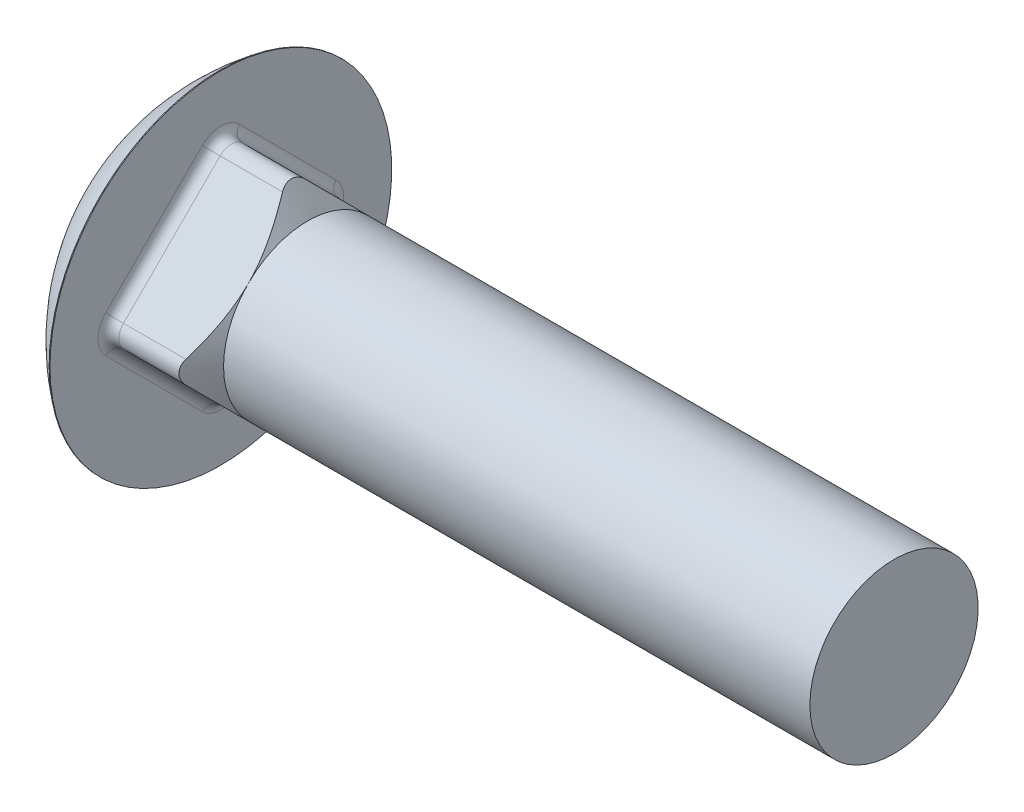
ISO-10303-21;
HEADER;
FILE_DESCRIPTION(('STEP AP214'),'2;1');
FILE_NAME('part.step','',(''),(''),'','','');
FILE_SCHEMA(('AUTOMOTIVE_DESIGN { 1 0 10303 214 1 1 1 1 }'));
ENDSEC;
DATA;
#1=APPLICATION_CONTEXT('core data for automotive mechanical design processes');
#2=APPLICATION_PROTOCOL_DEFINITION('international standard','automotive_design',2000,#1);
#3=PRODUCT_CONTEXT('',#1,'mechanical');
#4=PRODUCT('Part','Part','',(#3));
#5=PRODUCT_RELATED_PRODUCT_CATEGORY('part','',(#4));
#6=PRODUCT_DEFINITION_FORMATION('','',#4);
#7=PRODUCT_DEFINITION_CONTEXT('part definition',#1,'design');
#8=PRODUCT_DEFINITION('design','',#6,#7);
#9=PRODUCT_DEFINITION_SHAPE('','',#8);
#10=(LENGTH_UNIT() NAMED_UNIT(*) SI_UNIT(.MILLI.,.METRE.));
#11=(NAMED_UNIT(*) PLANE_ANGLE_UNIT() SI_UNIT($,.RADIAN.));
#12=(NAMED_UNIT(*) SI_UNIT($,.STERADIAN.) SOLID_ANGLE_UNIT());
#13=UNCERTAINTY_MEASURE_WITH_UNIT(LENGTH_MEASURE(1.E-05),#10,'distance_accuracy_value','');
#14=(GEOMETRIC_REPRESENTATION_CONTEXT(3) GLOBAL_UNCERTAINTY_ASSIGNED_CONTEXT((#13)) GLOBAL_UNIT_ASSIGNED_CONTEXT((#10,
#11,#12)) REPRESENTATION_CONTEXT('',''));
#15=CARTESIAN_POINT('',(0.,0.,0.));
#16=DIRECTION('',(0.,0.,1.));
#17=DIRECTION('',(1.,0.,0.));
#18=AXIS2_PLACEMENT_3D('',#15,#16,#17);
#19=CARTESIAN_POINT('',(26.2128,1.68828815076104,16.2722240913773));
#20=DIRECTION('',(0.,-0.707106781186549,-0.707106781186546));
#21=DIRECTION('',(0.,0.707106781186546,-0.707106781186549));
#22=AXIS2_PLACEMENT_3D('',#19,#20,#21);
#23=PLANE('',#22);
#24=CARTESIAN_POINT('',(24.0998422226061,16.2724240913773,1.68808815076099));
#25=CARTESIAN_POINT('',(24.1796497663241,16.1173593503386,1.84315289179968));
#26=CARTESIAN_POINT('',(24.2581086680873,15.9619481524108,1.99856408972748));
#27=CARTESIAN_POINT('',(24.4120519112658,15.6503819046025,2.31013033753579));
#28=CARTESIAN_POINT('',(24.4875360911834,15.4942268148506,2.46628542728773));
#29=CARTESIAN_POINT('',(24.7091843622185,15.024411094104,2.9361011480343));
#30=CARTESIAN_POINT('',(24.8504499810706,14.7095816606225,3.25093058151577));
#31=CARTESIAN_POINT('',(25.1181625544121,14.0744287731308,3.88608346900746));
#32=CARTESIAN_POINT('',(25.2445018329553,13.7540824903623,4.20642975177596));
#33=CARTESIAN_POINT('',(25.4780882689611,13.1099535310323,4.85055871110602));
#34=CARTESIAN_POINT('',(25.5853388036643,12.7861714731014,5.17434076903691));
#35=CARTESIAN_POINT('',(25.7734199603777,12.1487294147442,5.81178282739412));
#36=CARTESIAN_POINT('',(25.8551600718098,11.8352048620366,6.12530738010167));
#37=CARTESIAN_POINT('',(25.995092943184,11.2055045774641,6.75500766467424));
#38=CARTESIAN_POINT('',(26.0532856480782,10.889328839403,7.07118340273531));
#39=CARTESIAN_POINT('',(26.1435202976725,10.2561650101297,7.70434723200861));
#40=CARTESIAN_POINT('',(26.1756494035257,9.93918321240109,8.02132902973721));
#41=CARTESIAN_POINT('',(26.212576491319,9.30442489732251,8.6560873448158));
#42=CARTESIAN_POINT('',(26.2173758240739,8.98664842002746,8.97386382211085));
#43=CARTESIAN_POINT('',(26.2001253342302,8.37636377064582,9.58414847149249));
#44=CARTESIAN_POINT('',(26.1801479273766,8.08382492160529,9.87668732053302));
#45=CARTESIAN_POINT('',(26.1176102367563,7.49996676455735,10.460545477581));
#46=CARTESIAN_POINT('',(26.075049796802,7.20864746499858,10.7518647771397));
#47=CARTESIAN_POINT('',(25.9687884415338,6.62707683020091,11.3334354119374));
#48=CARTESIAN_POINT('',(25.905024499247,6.33683131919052,11.6236809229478));
#49=CARTESIAN_POINT('',(25.7585167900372,5.75877000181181,12.2017422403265));
#50=CARTESIAN_POINT('',(25.6757730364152,5.47095419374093,12.4895580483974));
#51=CARTESIAN_POINT('',(25.4899949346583,4.88652946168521,13.0739827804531));
#52=CARTESIAN_POINT('',(25.3862813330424,4.59002933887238,13.3704829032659));
#53=CARTESIAN_POINT('',(25.1634125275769,3.99992687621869,13.9605853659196));
#54=CARTESIAN_POINT('',(25.0442553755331,3.70632490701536,14.254187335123));
#55=CARTESIAN_POINT('',(24.793661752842,3.12373768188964,14.8367745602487));
#56=CARTESIAN_POINT('',(24.6623049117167,2.83473516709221,15.1257770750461));
#57=CARTESIAN_POINT('',(24.388733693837,2.25945449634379,15.7010577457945));
#58=CARTESIAN_POINT('',(24.2465244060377,1.9731751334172,15.9873371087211));
#59=CARTESIAN_POINT('',(24.0998422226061,1.68808815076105,16.2724240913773));
#60=B_SPLINE_CURVE_WITH_KNOTS('',3,(#24,#25,#26,#27,#28,#29,#30,#31,#32,#33,#34,#35,#36,#37,#38,
#39,#40,#41,#42,#43,#44,#45,#46,#47,#48,#49,#50,#51,#52,#53,#54,#55,#56,#57,#58,#59),
.UNSPECIFIED.,.F.,.F.,(4,2,2,2,2,2,2,2,2,2,2,2,2,2,2,2,2,4),(0.,0.700087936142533,
1.4002138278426,2.80128617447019,4.21191735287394,5.62229870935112,6.9743282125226,
8.32636087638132,9.67385325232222,11.0212790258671,12.2632245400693,13.5051786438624,
14.7508579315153,15.9965363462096,17.2920436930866,18.5877146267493,19.8754544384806,
21.162594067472),.UNSPECIFIED.);
#61=CARTESIAN_POINT('',(24.0999451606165,16.2722240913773,1.68828815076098));
#62=VERTEX_POINT('',#61);
#63=CARTESIAN_POINT('',(26.2128,8.98025612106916,8.98025612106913));
#64=VERTEX_POINT('',#63);
#65=EDGE_CURVE('E58',#62,#64,#60,.T.);
#66=ORIENTED_EDGE('',*,*,#65,.F.);
#67=DIRECTION('',(-1.,0.,0.));
#68=VECTOR('',#67,1.);
#69=CARTESIAN_POINT('',(26.2128,16.2722240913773,1.68828815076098));
#70=LINE('',#69,#68);
#71=CARTESIAN_POINT('',(14.6812,16.2722240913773,1.68828815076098));
#72=VERTEX_POINT('',#71);
#73=EDGE_CURVE('E313',#62,#72,#70,.T.);
#74=ORIENTED_EDGE('',*,*,#73,.T.);
#75=DIRECTION('',(0.,0.707106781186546,-0.707106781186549));
#76=VECTOR('',#75,1.);
#77=CARTESIAN_POINT('',(14.6812,1.68828815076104,16.2722240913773));
#78=LINE('',#77,#76);
#79=CARTESIAN_POINT('',(14.6812,1.68828815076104,16.2722240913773));
#80=VERTEX_POINT('',#79);
#81=EDGE_CURVE('E50',#72,#80,#78,.F.);
#82=ORIENTED_EDGE('',*,*,#81,.T.);
#83=DIRECTION('',(-1.,0.,0.));
#84=VECTOR('',#83,1.);
#85=CARTESIAN_POINT('',(26.2128,1.68828815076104,16.2722240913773));
#86=LINE('',#85,#84);
#87=CARTESIAN_POINT('',(24.0999451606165,1.68828815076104,16.2722240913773));
#88=VERTEX_POINT('',#87);
#89=EDGE_CURVE('E321',#88,#80,#86,.T.);
#90=ORIENTED_EDGE('',*,*,#89,.F.);
#91=EDGE_CURVE('E241',#64,#88,#60,.T.);
#92=ORIENTED_EDGE('',*,*,#91,.F.);
#93=EDGE_LOOP('',(#66,#74,#82,#90,#92));
#94=FACE_BOUND('',#93,.T.);
#95=ADVANCED_FACE('F41',(#94),#23,.F.);
#96=CARTESIAN_POINT('',(26.2128,-16.2722240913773,1.68828815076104));
#97=DIRECTION('',(0.,0.707106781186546,-0.707106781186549));
#98=DIRECTION('',(0.,0.707106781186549,0.707106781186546));
#99=AXIS2_PLACEMENT_3D('',#96,#97,#98);
#100=PLANE('',#99);
#101=CARTESIAN_POINT('',(24.0998422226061,-1.68808815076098,16.2724240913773));
#102=CARTESIAN_POINT('',(24.1796497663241,-1.84315289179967,16.1173593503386));
#103=CARTESIAN_POINT('',(24.2581086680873,-1.99856408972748,15.9619481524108));
#104=CARTESIAN_POINT('',(24.4120519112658,-2.31013033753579,15.6503819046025));
#105=CARTESIAN_POINT('',(24.4875360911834,-2.46628542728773,15.4942268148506));
#106=CARTESIAN_POINT('',(24.7091843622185,-2.93610114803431,15.024411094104));
#107=CARTESIAN_POINT('',(24.8504499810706,-3.25093058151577,14.7095816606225));
#108=CARTESIAN_POINT('',(25.118162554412,-3.88608346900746,14.0744287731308));
#109=CARTESIAN_POINT('',(25.2445018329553,-4.20642975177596,13.7540824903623));
#110=CARTESIAN_POINT('',(25.4780882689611,-4.85055871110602,13.1099535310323));
#111=CARTESIAN_POINT('',(25.5853388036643,-5.17434076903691,12.7861714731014));
#112=CARTESIAN_POINT('',(25.7734199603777,-5.81178282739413,12.1487294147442));
#113=CARTESIAN_POINT('',(25.8551600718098,-6.12530738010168,11.8352048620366));
#114=CARTESIAN_POINT('',(25.995092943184,-6.75500766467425,11.2055045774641));
#115=CARTESIAN_POINT('',(26.0532856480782,-7.07118340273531,10.889328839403));
#116=CARTESIAN_POINT('',(26.1435202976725,-7.70434723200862,10.2561650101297));
#117=CARTESIAN_POINT('',(26.1756494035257,-8.02132902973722,9.93918321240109));
#118=CARTESIAN_POINT('',(26.212576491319,-8.65608734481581,9.3044248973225));
#119=CARTESIAN_POINT('',(26.2173758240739,-8.97386382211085,8.98664842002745));
#120=CARTESIAN_POINT('',(26.2001253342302,-9.5841484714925,8.37636377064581));
#121=CARTESIAN_POINT('',(26.1801479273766,-9.87668732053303,8.08382492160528));
#122=CARTESIAN_POINT('',(26.1176102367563,-10.460545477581,7.49996676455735));
#123=CARTESIAN_POINT('',(26.075049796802,-10.7518647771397,7.20864746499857));
#124=CARTESIAN_POINT('',(25.9687884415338,-11.3334354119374,6.62707683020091));
#125=CARTESIAN_POINT('',(25.905024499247,-11.6236809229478,6.33683131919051));
#126=CARTESIAN_POINT('',(25.7585167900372,-12.2017422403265,5.7587700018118));
#127=CARTESIAN_POINT('',(25.6757730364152,-12.4895580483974,5.47095419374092));
#128=CARTESIAN_POINT('',(25.4899949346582,-13.0739827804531,4.8865294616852));
#129=CARTESIAN_POINT('',(25.3862813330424,-13.3704829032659,4.59002933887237));
#130=CARTESIAN_POINT('',(25.1634125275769,-13.9605853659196,3.99992687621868));
#131=CARTESIAN_POINT('',(25.0442553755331,-14.254187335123,3.70632490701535));
#132=CARTESIAN_POINT('',(24.793661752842,-14.8367745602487,3.12373768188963));
#133=CARTESIAN_POINT('',(24.6623049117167,-15.1257770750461,2.83473516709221));
#134=CARTESIAN_POINT('',(24.388733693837,-15.7010577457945,2.25945449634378));
#135=CARTESIAN_POINT('',(24.2465244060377,-15.9873371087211,1.97317513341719));
#136=CARTESIAN_POINT('',(24.0998422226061,-16.2724240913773,1.68808815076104));
#137=B_SPLINE_CURVE_WITH_KNOTS('',3,(#101,#102,#103,#104,#105,#106,#107,#108,#109,#110,#111,
#112,#113,#114,#115,#116,#117,#118,#119,#120,#121,#122,#123,#124,#125,#126,#127,#128,#129,#130,
#131,#132,#133,#134,#135,#136),.UNSPECIFIED.,.F.,.F.,(4,2,2,2,2,2,2,2,2,2,2,2,2,2,2,2,2,4),(0.,
0.700087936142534,1.4002138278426,2.80128617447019,4.21191735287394,5.62229870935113,
6.97432821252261,8.32636087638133,9.67385325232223,11.0212790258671,12.2632245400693,
13.5051786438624,14.7508579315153,15.9965363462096,17.2920436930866,18.5877146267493,
19.8754544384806,21.162594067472),.UNSPECIFIED.);
#138=CARTESIAN_POINT('',(24.0999451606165,-1.68828815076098,16.2722240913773));
#139=VERTEX_POINT('',#138);
#140=CARTESIAN_POINT('',(26.2128,-8.98025612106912,8.98025612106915));
#141=VERTEX_POINT('',#140);
#142=EDGE_CURVE('E143',#139,#141,#137,.T.);
#143=ORIENTED_EDGE('',*,*,#142,.F.);
#144=DIRECTION('',(-1.,0.,0.));
#145=VECTOR('',#144,1.);
#146=CARTESIAN_POINT('',(26.2128,-1.68828815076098,16.2722240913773));
#147=LINE('',#146,#145);
#148=CARTESIAN_POINT('',(14.6812,-1.68828815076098,16.2722240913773));
#149=VERTEX_POINT('',#148);
#150=EDGE_CURVE('E326',#139,#149,#147,.T.);
#151=ORIENTED_EDGE('',*,*,#150,.T.);
#152=DIRECTION('',(0.,0.707106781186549,0.707106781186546));
#153=VECTOR('',#152,1.);
#154=CARTESIAN_POINT('',(14.6812,-16.2722240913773,1.68828815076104));
#155=LINE('',#154,#153);
#156=CARTESIAN_POINT('',(14.6812,-16.2722240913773,1.68828815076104));
#157=VERTEX_POINT('',#156);
#158=EDGE_CURVE('E356',#149,#157,#155,.F.);
#159=ORIENTED_EDGE('',*,*,#158,.T.);
#160=DIRECTION('',(-1.,0.,0.));
#161=VECTOR('',#160,1.);
#162=CARTESIAN_POINT('',(26.2128,-16.2722240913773,1.68828815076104));
#163=LINE('',#162,#161);
#164=CARTESIAN_POINT('',(24.0999451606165,-16.2722240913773,1.68828815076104));
#165=VERTEX_POINT('',#164);
#166=EDGE_CURVE('E178',#165,#157,#163,.T.);
#167=ORIENTED_EDGE('',*,*,#166,.F.);
#168=EDGE_CURVE('E154',#141,#165,#137,.T.);
#169=ORIENTED_EDGE('',*,*,#168,.F.);
#170=EDGE_LOOP('',(#143,#151,#159,#167,#169));
#171=FACE_BOUND('',#170,.T.);
#172=ADVANCED_FACE('F176',(#171),#100,.F.);
#173=CARTESIAN_POINT('',(26.2128,-16.2722240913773,-1.68828815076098));
#174=DIRECTION('',(0.,0.707106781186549,0.707106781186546));
#175=DIRECTION('',(0.,-0.707106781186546,0.707106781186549));
#176=AXIS2_PLACEMENT_3D('',#173,#174,#175);
#177=PLANE('',#176);
#178=CARTESIAN_POINT('',(24.0998422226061,-16.2724240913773,-1.68808815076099));
#179=CARTESIAN_POINT('',(24.1796497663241,-16.1173593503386,-1.84315289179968));
#180=CARTESIAN_POINT('',(24.2581086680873,-15.9619481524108,-1.99856408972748));
#181=CARTESIAN_POINT('',(24.4120519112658,-15.6503819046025,-2.31013033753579));
#182=CARTESIAN_POINT('',(24.4875360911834,-15.4942268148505,-2.46628542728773));
#183=CARTESIAN_POINT('',(24.7091843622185,-15.024411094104,-2.93610114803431));
#184=CARTESIAN_POINT('',(24.8504499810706,-14.7095816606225,-3.25093058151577));
#185=CARTESIAN_POINT('',(25.1181625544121,-14.0744287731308,-3.88608346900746));
#186=CARTESIAN_POINT('',(25.2445018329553,-13.7540824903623,-4.20642975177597));
#187=CARTESIAN_POINT('',(25.4780882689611,-13.1099535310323,-4.85055871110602));
#188=CARTESIAN_POINT('',(25.5853388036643,-12.7861714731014,-5.17434076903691));
#189=CARTESIAN_POINT('',(25.7734199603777,-12.1487294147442,-5.81178282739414));
#190=CARTESIAN_POINT('',(25.8551600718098,-11.8352048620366,-6.12530738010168));
#191=CARTESIAN_POINT('',(25.995092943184,-11.205504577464,-6.75500766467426));
#192=CARTESIAN_POINT('',(26.0532856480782,-10.889328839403,-7.07118340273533));
#193=CARTESIAN_POINT('',(26.1435202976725,-10.2561650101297,-7.70434723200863));
#194=CARTESIAN_POINT('',(26.1756494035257,-9.93918321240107,-8.02132902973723));
#195=CARTESIAN_POINT('',(26.212576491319,-9.30442489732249,-8.65608734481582));
#196=CARTESIAN_POINT('',(26.2173758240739,-8.98664842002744,-8.97386382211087));
#197=CARTESIAN_POINT('',(26.2001253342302,-8.3763637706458,-9.58414847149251));
#198=CARTESIAN_POINT('',(26.1801479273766,-8.08382492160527,-9.87668732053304));
#199=CARTESIAN_POINT('',(26.1176102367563,-7.49996676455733,-10.460545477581));
#200=CARTESIAN_POINT('',(26.075049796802,-7.20864746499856,-10.7518647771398));
#201=CARTESIAN_POINT('',(25.9687884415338,-6.6270768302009,-11.3334354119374));
#202=CARTESIAN_POINT('',(25.905024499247,-6.3368313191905,-11.6236809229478));
#203=CARTESIAN_POINT('',(25.7585167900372,-5.7587700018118,-12.2017422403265));
#204=CARTESIAN_POINT('',(25.6757730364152,-5.47095419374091,-12.4895580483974));
#205=CARTESIAN_POINT('',(25.4899949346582,-4.88652946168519,-13.0739827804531));
#206=CARTESIAN_POINT('',(25.3862813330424,-4.59002933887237,-13.370482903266));
#207=CARTESIAN_POINT('',(25.1634125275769,-3.99992687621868,-13.9605853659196));
#208=CARTESIAN_POINT('',(25.0442553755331,-3.70632490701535,-14.254187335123));
#209=CARTESIAN_POINT('',(24.793661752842,-3.12373768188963,-14.8367745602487));
#210=CARTESIAN_POINT('',(24.6623049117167,-2.83473516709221,-15.1257770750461));
#211=CARTESIAN_POINT('',(24.388733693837,-2.25945449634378,-15.7010577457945));
#212=CARTESIAN_POINT('',(24.2465244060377,-1.97317513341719,-15.9873371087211));
#213=CARTESIAN_POINT('',(24.0998422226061,-1.68808815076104,-16.2724240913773));
#214=B_SPLINE_CURVE_WITH_KNOTS('',3,(#178,#179,#180,#181,#182,#183,#184,#185,#186,#187,#188,
#189,#190,#191,#192,#193,#194,#195,#196,#197,#198,#199,#200,#201,#202,#203,#204,#205,#206,#207,
#208,#209,#210,#211,#212,#213),.UNSPECIFIED.,.F.,.F.,(4,2,2,2,2,2,2,2,2,2,2,2,2,2,2,2,2,4),(0.,
0.700087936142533,1.4002138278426,2.80128617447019,4.21191735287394,5.62229870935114,
6.97432821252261,8.32636087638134,9.67385325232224,11.0212790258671,12.2632245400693,
13.5051786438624,14.7508579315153,15.9965363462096,17.2920436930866,18.5877146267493,
19.8754544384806,21.162594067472),.UNSPECIFIED.);
#215=CARTESIAN_POINT('',(24.0999451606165,-16.2722240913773,-1.68828815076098));
#216=VERTEX_POINT('',#215);
#217=CARTESIAN_POINT('',(26.2128,-8.98025612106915,-8.98025612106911));
#218=VERTEX_POINT('',#217);
#219=EDGE_CURVE('E163',#216,#218,#214,.T.);
#220=ORIENTED_EDGE('',*,*,#219,.F.);
#221=DIRECTION('',(-1.,0.,0.));
#222=VECTOR('',#221,1.);
#223=CARTESIAN_POINT('',(26.2128,-16.2722240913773,-1.68828815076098));
#224=LINE('',#223,#222);
#225=CARTESIAN_POINT('',(14.6812,-16.2722240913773,-1.68828815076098));
#226=VERTEX_POINT('',#225);
#227=EDGE_CURVE('E396',#216,#226,#224,.T.);
#228=ORIENTED_EDGE('',*,*,#227,.T.);
#229=DIRECTION('',(0.,-0.707106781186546,0.707106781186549));
#230=VECTOR('',#229,1.);
#231=CARTESIAN_POINT('',(14.6812,-16.2722240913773,-1.68828815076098));
#232=LINE('',#231,#230);
#233=CARTESIAN_POINT('',(14.6812,-1.68828815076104,-16.2722240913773));
#234=VERTEX_POINT('',#233);
#235=EDGE_CURVE('E353',#226,#234,#232,.F.);
#236=ORIENTED_EDGE('',*,*,#235,.T.);
#237=DIRECTION('',(-1.,0.,0.));
#238=VECTOR('',#237,1.);
#239=CARTESIAN_POINT('',(26.2128,-1.68828815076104,-16.2722240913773));
#240=LINE('',#239,#238);
#241=CARTESIAN_POINT('',(24.0999451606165,-1.68828815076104,-16.2722240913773));
#242=VERTEX_POINT('',#241);
#243=EDGE_CURVE('E392',#242,#234,#240,.T.);
#244=ORIENTED_EDGE('',*,*,#243,.F.);
#245=EDGE_CURVE('E227',#218,#242,#214,.T.);
#246=ORIENTED_EDGE('',*,*,#245,.F.);
#247=EDGE_LOOP('',(#220,#228,#236,#244,#246));
#248=FACE_BOUND('',#247,.T.);
#249=ADVANCED_FACE('F310',(#248),#177,.F.);
#250=CARTESIAN_POINT('',(26.2128,1.68828815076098,-16.2722240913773));
#251=DIRECTION('',(0.,-0.707106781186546,0.707106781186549));
#252=DIRECTION('',(0.,-0.707106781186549,-0.707106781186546));
#253=AXIS2_PLACEMENT_3D('',#250,#251,#252);
#254=PLANE('',#253);
#255=CARTESIAN_POINT('',(24.0998422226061,1.68808815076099,-16.2724240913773));
#256=CARTESIAN_POINT('',(24.1796497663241,1.84315289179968,-16.1173593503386));
#257=CARTESIAN_POINT('',(24.2581086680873,1.99856408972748,-15.9619481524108));
#258=CARTESIAN_POINT('',(24.4120519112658,2.31013033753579,-15.6503819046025));
#259=CARTESIAN_POINT('',(24.4875360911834,2.46628542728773,-15.4942268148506));
#260=CARTESIAN_POINT('',(24.7091843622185,2.93610114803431,-15.024411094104));
#261=CARTESIAN_POINT('',(24.8504499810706,3.25093058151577,-14.7095816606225));
#262=CARTESIAN_POINT('',(25.1181625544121,3.88608346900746,-14.0744287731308));
#263=CARTESIAN_POINT('',(25.2445018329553,4.20642975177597,-13.7540824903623));
#264=CARTESIAN_POINT('',(25.4780882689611,4.85055871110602,-13.1099535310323));
#265=CARTESIAN_POINT('',(25.5853388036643,5.17434076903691,-12.7861714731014));
#266=CARTESIAN_POINT('',(25.7734199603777,5.81178282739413,-12.1487294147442));
#267=CARTESIAN_POINT('',(25.8551600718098,6.12530738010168,-11.8352048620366));
#268=CARTESIAN_POINT('',(25.995092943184,6.75500766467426,-11.205504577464));
#269=CARTESIAN_POINT('',(26.0532856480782,7.07118340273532,-10.889328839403));
#270=CARTESIAN_POINT('',(26.1435202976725,7.70434723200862,-10.2561650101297));
#271=CARTESIAN_POINT('',(26.1756494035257,8.02132902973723,-9.93918321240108));
#272=CARTESIAN_POINT('',(26.212576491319,8.65608734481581,-9.30442489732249));
#273=CARTESIAN_POINT('',(26.2173758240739,8.97386382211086,-8.98664842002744));
#274=CARTESIAN_POINT('',(26.2001253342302,9.5841484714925,-8.3763637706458));
#275=CARTESIAN_POINT('',(26.1801479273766,9.87668732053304,-8.08382492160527));
#276=CARTESIAN_POINT('',(26.1176102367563,10.460545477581,-7.49996676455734));
#277=CARTESIAN_POINT('',(26.075049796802,10.7518647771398,-7.20864746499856));
#278=CARTESIAN_POINT('',(25.9687884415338,11.3334354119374,-6.6270768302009));
#279=CARTESIAN_POINT('',(25.905024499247,11.6236809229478,-6.33683131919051));
#280=CARTESIAN_POINT('',(25.7585167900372,12.2017422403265,-5.7587700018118));
#281=CARTESIAN_POINT('',(25.6757730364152,12.4895580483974,-5.47095419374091));
#282=CARTESIAN_POINT('',(25.4899949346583,13.0739827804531,-4.88652946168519));
#283=CARTESIAN_POINT('',(25.3862813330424,13.370482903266,-4.59002933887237));
#284=CARTESIAN_POINT('',(25.1634125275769,13.9605853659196,-3.99992687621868));
#285=CARTESIAN_POINT('',(25.0442553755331,14.254187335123,-3.70632490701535));
#286=CARTESIAN_POINT('',(24.793661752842,14.8367745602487,-3.12373768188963));
#287=CARTESIAN_POINT('',(24.6623049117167,15.1257770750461,-2.83473516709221));
#288=CARTESIAN_POINT('',(24.388733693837,15.7010577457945,-2.25945449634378));
#289=CARTESIAN_POINT('',(24.2465244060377,15.9873371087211,-1.97317513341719));
#290=CARTESIAN_POINT('',(24.0998422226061,16.2724240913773,-1.68808815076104));
#291=B_SPLINE_CURVE_WITH_KNOTS('',3,(#255,#256,#257,#258,#259,#260,#261,#262,#263,#264,#265,
#266,#267,#268,#269,#270,#271,#272,#273,#274,#275,#276,#277,#278,#279,#280,#281,#282,#283,#284,
#285,#286,#287,#288,#289,#290),.UNSPECIFIED.,.F.,.F.,(4,2,2,2,2,2,2,2,2,2,2,2,2,2,2,2,2,4),(0.,
0.700087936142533,1.4002138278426,2.80128617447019,4.21191735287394,5.62229870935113,
6.97432821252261,8.32636087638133,9.67385325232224,11.0212790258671,12.2632245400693,
13.5051786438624,14.7508579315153,15.9965363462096,17.2920436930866,18.5877146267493,
19.8754544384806,21.162594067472),.UNSPECIFIED.);
#292=CARTESIAN_POINT('',(24.0999451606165,1.68828815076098,-16.2722240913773));
#293=VERTEX_POINT('',#292);
#294=CARTESIAN_POINT('',(26.2128,8.98025612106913,-8.98025612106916));
#295=VERTEX_POINT('',#294);
#296=EDGE_CURVE('E66',#293,#295,#291,.T.);
#297=ORIENTED_EDGE('',*,*,#296,.F.);
#298=DIRECTION('',(-1.,0.,0.));
#299=VECTOR('',#298,1.);
#300=CARTESIAN_POINT('',(26.2128,1.68828815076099,-16.2722240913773));
#301=LINE('',#300,#299);
#302=CARTESIAN_POINT('',(14.6812,1.68828815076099,-16.2722240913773));
#303=VERTEX_POINT('',#302);
#304=EDGE_CURVE('E391',#293,#303,#301,.T.);
#305=ORIENTED_EDGE('',*,*,#304,.T.);
#306=DIRECTION('',(0.,-0.707106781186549,-0.707106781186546));
#307=VECTOR('',#306,1.);
#308=CARTESIAN_POINT('',(14.6812,1.68828815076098,-16.2722240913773));
#309=LINE('',#308,#307);
#310=CARTESIAN_POINT('',(14.6812,16.2722240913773,-1.68828815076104));
#311=VERTEX_POINT('',#310);
#312=EDGE_CURVE('E364',#303,#311,#309,.F.);
#313=ORIENTED_EDGE('',*,*,#312,.T.);
#314=DIRECTION('',(-1.,0.,0.));
#315=VECTOR('',#314,1.);
#316=CARTESIAN_POINT('',(26.2128,16.2722240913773,-1.68828815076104));
#317=LINE('',#316,#315);
#318=CARTESIAN_POINT('',(24.0999451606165,16.2722240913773,-1.68828815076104));
#319=VERTEX_POINT('',#318);
#320=EDGE_CURVE('E388',#319,#311,#317,.T.);
#321=ORIENTED_EDGE('',*,*,#320,.F.);
#322=EDGE_CURVE('E179',#295,#319,#291,.T.);
#323=ORIENTED_EDGE('',*,*,#322,.F.);
#324=EDGE_LOOP('',(#297,#305,#313,#321,#323));
#325=FACE_BOUND('',#324,.T.);
#326=ADVANCED_FACE('F208',(#325),#254,.F.);
#327=CARTESIAN_POINT('',(26.2128,14.5839359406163,0.));
#328=DIRECTION('',(-1.,0.,0.));
#329=DIRECTION('',(0.,0.,1.));
#330=AXIS2_PLACEMENT_3D('',#327,#328,#329);
#331=CYLINDRICAL_SURFACE('',#330,2.3876);
#332=CARTESIAN_POINT('',(24.1000480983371,16.2720240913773,-1.68848812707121));
#333=CARTESIAN_POINT('',(24.0775747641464,16.3156876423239,-1.64483319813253));
#334=CARTESIAN_POINT('',(24.0559490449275,16.3578605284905,-1.59928246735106));
#335=CARTESIAN_POINT('',(24.0145185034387,16.4389088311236,-1.50452779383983));
#336=CARTESIAN_POINT('',(23.994714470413,16.4777828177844,-1.45532228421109));
#337=CARTESIAN_POINT('',(23.9381956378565,16.5890372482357,-1.3023388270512));
#338=CARTESIAN_POINT('',(23.904441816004,16.6559181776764,-1.19332482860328));
#339=CARTESIAN_POINT('',(23.8459816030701,16.7722032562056,-0.963712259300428));
#340=CARTESIAN_POINT('',(23.821301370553,16.8215568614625,-0.843081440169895));
#341=CARTESIAN_POINT('',(23.782092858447,16.9001411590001,-0.593999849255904));
#342=CARTESIAN_POINT('',(23.7675500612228,16.9294006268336,-0.46556054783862));
#343=CARTESIAN_POINT('',(23.7497092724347,16.9653177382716,-0.212312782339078));
#344=CARTESIAN_POINT('',(23.7458179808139,16.9731678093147,-0.0877141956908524));
#345=CARTESIAN_POINT('',(23.7477169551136,16.9693401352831,0.161100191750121));
#346=CARTESIAN_POINT('',(23.7535058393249,16.9576651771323,0.285316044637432));
#347=CARTESIAN_POINT('',(23.7741981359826,16.9160322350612,0.525705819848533));
#348=CARTESIAN_POINT('',(23.7888039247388,16.8866713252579,0.642009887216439));
#349=CARTESIAN_POINT('',(23.8263649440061,16.8114340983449,0.867797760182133));
#350=CARTESIAN_POINT('',(23.8493283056,16.7655416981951,0.977274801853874));
#351=CARTESIAN_POINT('',(23.9052274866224,16.6543604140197,1.19594287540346));
#352=CARTESIAN_POINT('',(23.9388573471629,16.5877309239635,1.3042795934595));
#353=CARTESIAN_POINT('',(23.9951416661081,16.4769438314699,1.45640206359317));
#354=CARTESIAN_POINT('',(24.0148723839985,16.4382154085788,1.50537143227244));
#355=CARTESIAN_POINT('',(24.0561385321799,16.3574910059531,1.59968116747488));
#356=CARTESIAN_POINT('',(24.0776730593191,16.3154966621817,1.64502332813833));
#357=CARTESIAN_POINT('',(24.1000480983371,16.2720240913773,1.68848812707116));
#358=B_SPLINE_CURVE_WITH_KNOTS('',3,(#332,#333,#334,#335,#336,#337,#338,#339,#340,#341,#342,
#343,#344,#345,#346,#347,#348,#349,#350,#351,#352,#353,#354,#355,#356,#357),.UNSPECIFIED.,.F.,
.F.,(4,2,2,2,2,2,2,2,2,2,2,2,4),(0.,0.197020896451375,0.394126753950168,0.788924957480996,
1.18485257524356,1.58021202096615,1.95305265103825,2.32584006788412,2.68669707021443,
3.04790609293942,3.4405552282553,3.63681089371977,3.83296887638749),.UNSPECIFIED.);
#359=EDGE_CURVE('E235',#319,#62,#358,.T.);
#360=ORIENTED_EDGE('',*,*,#359,.F.);
#361=ORIENTED_EDGE('',*,*,#320,.T.);
#362=CARTESIAN_POINT('',(14.6812,14.5839359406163,0.));
#363=DIRECTION('',(1.,0.,0.));
#364=DIRECTION('',(0.,0.,-1.));
#365=AXIS2_PLACEMENT_3D('',#362,#363,#364);
#366=CIRCLE('',#365,2.3876);
#367=EDGE_CURVE('E11',#311,#72,#366,.T.);
#368=ORIENTED_EDGE('',*,*,#367,.T.);
#369=ORIENTED_EDGE('',*,*,#73,.F.);
#370=EDGE_LOOP('',(#360,#361,#368,#369));
#371=FACE_BOUND('',#370,.T.);
#372=ADVANCED_FACE('F248',(#371),#331,.T.);
#373=CARTESIAN_POINT('',(26.2128,0.,14.5839359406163));
#374=DIRECTION('',(-1.,0.,0.));
#375=DIRECTION('',(0.,0.,1.));
#376=AXIS2_PLACEMENT_3D('',#373,#374,#375);
#377=CYLINDRICAL_SURFACE('',#376,2.3876);
#378=CARTESIAN_POINT('',(24.100048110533,1.68848815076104,16.2720240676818));
#379=CARTESIAN_POINT('',(24.077574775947,1.64483322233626,16.3156876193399));
#380=CARTESIAN_POINT('',(24.0559490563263,1.59928249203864,16.3578605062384));
#381=CARTESIAN_POINT('',(24.0145185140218,1.50452781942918,16.4389088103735));
#382=CARTESIAN_POINT('',(23.9947144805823,1.4553223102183,16.4777827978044));
#383=CARTESIAN_POINT('',(23.9381956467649,1.30233885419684,16.5890372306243));
#384=CARTESIAN_POINT('',(23.9044418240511,1.19332485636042,16.6559181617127));
#385=CARTESIAN_POINT('',(23.8459816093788,0.963712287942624,16.7722032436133));
#386=CARTESIAN_POINT('',(23.8213013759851,0.843081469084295,16.8215568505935));
#387=CARTESIAN_POINT('',(23.782092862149,0.593999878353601,16.9001411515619));
#388=CARTESIAN_POINT('',(23.7675500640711,0.465560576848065,16.9294006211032));
#389=CARTESIAN_POINT('',(23.7497092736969,0.212312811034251,16.965317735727));
#390=CARTESIAN_POINT('',(23.7458179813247,0.0877142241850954,16.9731678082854));
#391=CARTESIAN_POINT('',(23.7477169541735,-0.16110016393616,16.9693401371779));
#392=CARTESIAN_POINT('',(23.7535058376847,-0.285316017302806,16.9576651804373));
#393=CARTESIAN_POINT('',(23.7741981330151,-0.525705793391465,16.9160322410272));
#394=CARTESIAN_POINT('',(23.7888039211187,-0.642009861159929,16.8866713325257));
#395=CARTESIAN_POINT('',(23.8263649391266,-0.867797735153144,16.8114341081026));
#396=CARTESIAN_POINT('',(23.849328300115,-0.977274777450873,16.7655417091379));
#397=CARTESIAN_POINT('',(23.9052274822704,-1.19594286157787,16.6543604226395));
#398=CARTESIAN_POINT('',(23.9388573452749,-1.30427958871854,16.5877309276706));
#399=CARTESIAN_POINT('',(23.9951416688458,-1.45640207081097,16.4769438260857));
#400=CARTESIAN_POINT('',(24.0148723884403,-1.50537144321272,16.438215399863));
#401=CARTESIAN_POINT('',(24.0561385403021,-1.59968118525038,16.3574909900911));
#402=CARTESIAN_POINT('',(24.0776730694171,-1.6450233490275,16.315496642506));
#403=CARTESIAN_POINT('',(24.100048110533,-1.68848815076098,16.2720240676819));
#404=B_SPLINE_CURVE_WITH_KNOTS('',3,(#378,#379,#380,#381,#382,#383,#384,#385,#386,#387,#388,
#389,#390,#391,#392,#393,#394,#395,#396,#397,#398,#399,#400,#401,#402,#403),.UNSPECIFIED.,.F.,
.F.,(4,2,2,2,2,2,2,2,2,2,2,2,4),(0.,0.197020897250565,0.39412675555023,0.78892496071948,
1.18485258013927,1.58021202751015,1.95305265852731,2.32584007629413,2.68669707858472,
3.04790610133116,3.44055526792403,3.63681094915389,3.83296894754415),.UNSPECIFIED.);
#405=EDGE_CURVE('E150',#88,#139,#404,.T.);
#406=ORIENTED_EDGE('',*,*,#405,.F.);
#407=ORIENTED_EDGE('',*,*,#89,.T.);
#408=CARTESIAN_POINT('',(14.6812,0.,14.5839359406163));
#409=DIRECTION('',(1.,0.,0.));
#410=DIRECTION('',(0.,0.,-1.));
#411=AXIS2_PLACEMENT_3D('',#408,#409,#410);
#412=CIRCLE('',#411,2.3876);
#413=EDGE_CURVE('E361',#80,#149,#412,.T.);
#414=ORIENTED_EDGE('',*,*,#413,.T.);
#415=ORIENTED_EDGE('',*,*,#150,.F.);
#416=EDGE_LOOP('',(#406,#407,#414,#415));
#417=FACE_BOUND('',#416,.T.);
#418=ADVANCED_FACE('F252',(#417),#377,.T.);
#419=CARTESIAN_POINT('',(26.2128,-14.5839359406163,0.));
#420=DIRECTION('',(-1.,0.,0.));
#421=DIRECTION('',(0.,0.,1.));
#422=AXIS2_PLACEMENT_3D('',#419,#420,#421);
#423=CYLINDRICAL_SURFACE('',#422,2.3876);
#424=CARTESIAN_POINT('',(24.1000480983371,-16.2720240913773,1.68848812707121));
#425=CARTESIAN_POINT('',(24.0775747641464,-16.3156876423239,1.64483319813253));
#426=CARTESIAN_POINT('',(24.0559490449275,-16.3578605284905,1.59928246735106));
#427=CARTESIAN_POINT('',(24.0145185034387,-16.4389088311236,1.50452779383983));
#428=CARTESIAN_POINT('',(23.994714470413,-16.4777828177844,1.45532228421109));
#429=CARTESIAN_POINT('',(23.9381956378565,-16.5890372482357,1.3023388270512));
#430=CARTESIAN_POINT('',(23.904441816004,-16.6559181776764,1.19332482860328));
#431=CARTESIAN_POINT('',(23.8459816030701,-16.7722032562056,0.963712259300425));
#432=CARTESIAN_POINT('',(23.821301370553,-16.8215568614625,0.843081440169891));
#433=CARTESIAN_POINT('',(23.782092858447,-16.9001411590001,0.5939998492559));
#434=CARTESIAN_POINT('',(23.7675500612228,-16.9294006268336,0.465560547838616));
#435=CARTESIAN_POINT('',(23.7497092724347,-16.9653177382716,0.212312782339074));
#436=CARTESIAN_POINT('',(23.7458179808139,-16.9731678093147,0.0877141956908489));
#437=CARTESIAN_POINT('',(23.7477169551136,-16.9693401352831,-0.161100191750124));
#438=CARTESIAN_POINT('',(23.7535058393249,-16.9576651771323,-0.285316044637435));
#439=CARTESIAN_POINT('',(23.7741981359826,-16.9160322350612,-0.525705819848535));
#440=CARTESIAN_POINT('',(23.7888039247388,-16.8866713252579,-0.64200988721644));
#441=CARTESIAN_POINT('',(23.8263649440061,-16.8114340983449,-0.867797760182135));
#442=CARTESIAN_POINT('',(23.8493283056,-16.7655416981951,-0.977274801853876));
#443=CARTESIAN_POINT('',(23.9052274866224,-16.6543604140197,-1.19594287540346));
#444=CARTESIAN_POINT('',(23.9388573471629,-16.5877309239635,-1.3042795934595));
#445=CARTESIAN_POINT('',(23.9951416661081,-16.4769438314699,-1.45640206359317));
#446=CARTESIAN_POINT('',(24.0148723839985,-16.4382154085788,-1.50537143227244));
#447=CARTESIAN_POINT('',(24.0561385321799,-16.3574910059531,-1.59968116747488));
#448=CARTESIAN_POINT('',(24.0776730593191,-16.3154966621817,-1.64502332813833));
#449=CARTESIAN_POINT('',(24.1000480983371,-16.2720240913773,-1.68848812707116));
#450=B_SPLINE_CURVE_WITH_KNOTS('',3,(#424,#425,#426,#427,#428,#429,#430,#431,#432,#433,#434,
#435,#436,#437,#438,#439,#440,#441,#442,#443,#444,#445,#446,#447,#448,#449),.UNSPECIFIED.,.F.,
.F.,(4,2,2,2,2,2,2,2,2,2,2,2,4),(0.,0.197020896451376,0.394126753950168,0.788924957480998,
1.18485257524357,1.58021202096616,1.95305265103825,2.32584006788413,2.68669707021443,
3.04790609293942,3.4405552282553,3.63681089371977,3.83296887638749),.UNSPECIFIED.);
#451=EDGE_CURVE('E180',#165,#216,#450,.T.);
#452=ORIENTED_EDGE('',*,*,#451,.F.);
#453=ORIENTED_EDGE('',*,*,#166,.T.);
#454=CARTESIAN_POINT('',(14.6812,-14.5839359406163,0.));
#455=DIRECTION('',(1.,0.,0.));
#456=DIRECTION('',(0.,0.,-1.));
#457=AXIS2_PLACEMENT_3D('',#454,#455,#456);
#458=CIRCLE('',#457,2.3876);
#459=EDGE_CURVE('E167',#157,#226,#458,.T.);
#460=ORIENTED_EDGE('',*,*,#459,.T.);
#461=ORIENTED_EDGE('',*,*,#227,.F.);
#462=EDGE_LOOP('',(#452,#453,#460,#461));
#463=FACE_BOUND('',#462,.T.);
#464=ADVANCED_FACE('F411',(#463),#423,.T.);
#465=CARTESIAN_POINT('',(26.2128,0.,-14.5839359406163));
#466=DIRECTION('',(-1.,0.,0.));
#467=DIRECTION('',(0.,0.,1.));
#468=AXIS2_PLACEMENT_3D('',#465,#466,#467);
#469=CYLINDRICAL_SURFACE('',#468,2.3876);
#470=CARTESIAN_POINT('',(24.100048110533,-1.68848815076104,-16.2720240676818));
#471=CARTESIAN_POINT('',(24.077574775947,-1.64483322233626,-16.3156876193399));
#472=CARTESIAN_POINT('',(24.0559490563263,-1.59928249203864,-16.3578605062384));
#473=CARTESIAN_POINT('',(24.0145185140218,-1.50452781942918,-16.4389088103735));
#474=CARTESIAN_POINT('',(23.9947144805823,-1.4553223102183,-16.4777827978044));
#475=CARTESIAN_POINT('',(23.9381956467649,-1.30233885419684,-16.5890372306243));
#476=CARTESIAN_POINT('',(23.9044418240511,-1.19332485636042,-16.6559181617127));
#477=CARTESIAN_POINT('',(23.8459816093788,-0.963712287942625,-16.7722032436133));
#478=CARTESIAN_POINT('',(23.8213013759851,-0.843081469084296,-16.8215568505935));
#479=CARTESIAN_POINT('',(23.782092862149,-0.593999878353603,-16.9001411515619));
#480=CARTESIAN_POINT('',(23.7675500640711,-0.465560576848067,-16.9294006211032));
#481=CARTESIAN_POINT('',(23.7497092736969,-0.212312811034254,-16.965317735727));
#482=CARTESIAN_POINT('',(23.7458179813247,-0.0877142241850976,-16.9731678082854));
#483=CARTESIAN_POINT('',(23.7477169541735,0.161100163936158,-16.9693401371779));
#484=CARTESIAN_POINT('',(23.7535058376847,0.285316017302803,-16.9576651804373));
#485=CARTESIAN_POINT('',(23.7741981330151,0.525705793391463,-16.9160322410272));
#486=CARTESIAN_POINT('',(23.7888039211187,0.642009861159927,-16.8866713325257));
#487=CARTESIAN_POINT('',(23.8263649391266,0.867797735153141,-16.8114341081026));
#488=CARTESIAN_POINT('',(23.849328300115,0.97727477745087,-16.7655417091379));
#489=CARTESIAN_POINT('',(23.9052274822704,1.19594286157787,-16.6543604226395));
#490=CARTESIAN_POINT('',(23.9388573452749,1.30427958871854,-16.5877309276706));
#491=CARTESIAN_POINT('',(23.9951416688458,1.45640207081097,-16.4769438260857));
#492=CARTESIAN_POINT('',(24.0148723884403,1.50537144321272,-16.438215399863));
#493=CARTESIAN_POINT('',(24.0561385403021,1.59968118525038,-16.3574909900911));
#494=CARTESIAN_POINT('',(24.0776730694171,1.6450233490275,-16.315496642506));
#495=CARTESIAN_POINT('',(24.100048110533,1.68848815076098,-16.2720240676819));
#496=B_SPLINE_CURVE_WITH_KNOTS('',3,(#470,#471,#472,#473,#474,#475,#476,#477,#478,#479,#480,
#481,#482,#483,#484,#485,#486,#487,#488,#489,#490,#491,#492,#493,#494,#495),.UNSPECIFIED.,.F.,
.F.,(4,2,2,2,2,2,2,2,2,2,2,2,4),(0.,0.197020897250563,0.394126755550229,0.788924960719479,
1.18485258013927,1.58021202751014,1.95305265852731,2.32584007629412,2.68669707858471,
3.04790610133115,3.44055526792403,3.63681094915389,3.83296894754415),.UNSPECIFIED.);
#497=EDGE_CURVE('E214',#242,#293,#496,.T.);
#498=ORIENTED_EDGE('',*,*,#497,.F.);
#499=ORIENTED_EDGE('',*,*,#243,.T.);
#500=CARTESIAN_POINT('',(14.6812,0.,-14.5839359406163));
#501=DIRECTION('',(1.,0.,0.));
#502=DIRECTION('',(0.,0.,-1.));
#503=AXIS2_PLACEMENT_3D('',#500,#501,#502);
#504=CIRCLE('',#503,2.3876);
#505=EDGE_CURVE('E358',#234,#303,#504,.T.);
#506=ORIENTED_EDGE('',*,*,#505,.T.);
#507=ORIENTED_EDGE('',*,*,#304,.F.);
#508=EDGE_LOOP('',(#498,#499,#506,#507));
#509=FACE_BOUND('',#508,.T.);
#510=ADVANCED_FACE('F263',(#509),#469,.T.);
#511=CARTESIAN_POINT('',(13.1064,25.7937,0.));
#512=DIRECTION('',(1.,0.,0.));
#513=DIRECTION('',(0.,0.,-1.));
#514=AXIS2_PLACEMENT_3D('',#511,#512,#513);
#515=PLANE('',#514);
#516=DIRECTION('',(0.,-0.707106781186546,0.707106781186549));
#517=VECTOR('',#516,1.);
#518=CARTESIAN_POINT('',(13.1064,2.80304211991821,-22.9906578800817));
#519=LINE('',#518,#517);
#520=CARTESIAN_POINT('',(13.1064,-2.80183990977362,-17.3857758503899));
#521=VERTEX_POINT('',#520);
#522=CARTESIAN_POINT('',(13.1064,-17.3857758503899,-2.80183990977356));
#523=VERTEX_POINT('',#522);
#524=EDGE_CURVE('E348',#521,#523,#519,.T.);
#525=ORIENTED_EDGE('',*,*,#524,.T.);
#526=CARTESIAN_POINT('',(13.1064,-14.5839359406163,0.));
#527=DIRECTION('',(1.,0.,0.));
#528=DIRECTION('',(0.,0.,-1.));
#529=AXIS2_PLACEMENT_3D('',#526,#527,#528);
#530=CIRCLE('',#529,3.9624);
#531=CARTESIAN_POINT('',(13.1064,-17.3857758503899,2.80183990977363));
#532=VERTEX_POINT('',#531);
#533=EDGE_CURVE('E350',#523,#532,#530,.F.);
#534=ORIENTED_EDGE('',*,*,#533,.T.);
#535=DIRECTION('',(0.,0.707106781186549,0.707106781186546));
#536=VECTOR('',#535,1.);
#537=CARTESIAN_POINT('',(13.1064,2.80304211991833,22.9906578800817));
#538=LINE('',#537,#536);
#539=CARTESIAN_POINT('',(13.1064,-2.80183990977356,17.3857758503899));
#540=VERTEX_POINT('',#539);
#541=EDGE_CURVE('E346',#532,#540,#538,.T.);
#542=ORIENTED_EDGE('',*,*,#541,.T.);
#543=CARTESIAN_POINT('',(13.1064,0.,14.5839359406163));
#544=DIRECTION('',(1.,0.,0.));
#545=DIRECTION('',(0.,0.,-1.));
#546=AXIS2_PLACEMENT_3D('',#543,#544,#545);
#547=CIRCLE('',#546,3.9624);
#548=CARTESIAN_POINT('',(13.1064,2.80183990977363,17.3857758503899));
#549=VERTEX_POINT('',#548);
#550=EDGE_CURVE('E342',#540,#549,#547,.F.);
#551=ORIENTED_EDGE('',*,*,#550,.T.);
#552=DIRECTION('',(0.,0.707106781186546,-0.707106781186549));
#553=VECTOR('',#552,1.);
#554=CARTESIAN_POINT('',(13.1064,22.9906578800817,-2.80304211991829));
#555=LINE('',#554,#553);
#556=CARTESIAN_POINT('',(13.1064,17.3857758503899,2.80183990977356));
#557=VERTEX_POINT('',#556);
#558=EDGE_CURVE('E338',#549,#557,#555,.T.);
#559=ORIENTED_EDGE('',*,*,#558,.T.);
#560=CARTESIAN_POINT('',(13.1064,14.5839359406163,0.));
#561=DIRECTION('',(1.,0.,0.));
#562=DIRECTION('',(0.,0.,-1.));
#563=AXIS2_PLACEMENT_3D('',#560,#561,#562);
#564=CIRCLE('',#563,3.9624);
#565=CARTESIAN_POINT('',(13.1064,17.3857758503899,-2.80183990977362));
#566=VERTEX_POINT('',#565);
#567=EDGE_CURVE('E336',#557,#566,#564,.F.);
#568=ORIENTED_EDGE('',*,*,#567,.T.);
#569=DIRECTION('',(0.,-0.707106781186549,-0.707106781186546));
#570=VECTOR('',#569,1.);
#571=CARTESIAN_POINT('',(13.1064,22.9906578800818,2.80304211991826));
#572=LINE('',#571,#570);
#573=CARTESIAN_POINT('',(13.1064,2.80183990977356,-17.3857758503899));
#574=VERTEX_POINT('',#573);
#575=EDGE_CURVE('E340',#566,#574,#572,.T.);
#576=ORIENTED_EDGE('',*,*,#575,.T.);
#577=CARTESIAN_POINT('',(13.1064,0.,-14.5839359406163));
#578=DIRECTION('',(1.,0.,0.));
#579=DIRECTION('',(0.,0.,-1.));
#580=AXIS2_PLACEMENT_3D('',#577,#578,#579);
#581=CIRCLE('',#580,3.9624);
#582=EDGE_CURVE('E344',#574,#521,#581,.F.);
#583=ORIENTED_EDGE('',*,*,#582,.T.);
#584=EDGE_LOOP('',(#525,#534,#542,#551,#559,#568,#576,#583));
#585=FACE_BOUND('',#584,.T.);
#586=CARTESIAN_POINT('',(13.1064,0.,0.));
#587=DIRECTION('',(-1.,0.,0.));
#588=DIRECTION('',(0.,0.,1.));
#589=AXIS2_PLACEMENT_3D('',#586,#587,#588);
#590=CIRCLE('',#589,25.7937);
#591=CARTESIAN_POINT('',(13.1064,0.,25.7937));
#592=VERTEX_POINT('',#591);
#593=EDGE_CURVE('E324',#592,#592,#590,.T.);
#594=ORIENTED_EDGE('',*,*,#593,.F.);
#595=EDGE_LOOP('',(#594));
#596=FACE_BOUND('',#595,.T.);
#597=ADVANCED_FACE('F260',(#585,#596),#515,.T.);
#598=CARTESIAN_POINT('',(32.1193500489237,0.,0.));
#599=DIRECTION('',(-1.,0.,0.));
#600=DIRECTION('',(0.,1.,0.));
#601=AXIS2_PLACEMENT_3D('',#598,#599,#600);
#602=SPHERICAL_SURFACE('',#601,32.1193500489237);
#603=CARTESIAN_POINT('',(12.9794,0.,0.));
#604=DIRECTION('',(-1.,0.,0.));
#605=DIRECTION('',(0.,0.,1.));
#606=AXIS2_PLACEMENT_3D('',#603,#604,#605);
#607=CIRCLE('',#606,25.7937);
#608=CARTESIAN_POINT('',(12.9794,0.,25.7937));
#609=VERTEX_POINT('',#608);
#610=EDGE_CURVE('E320',#609,#609,#607,.T.);
#611=ORIENTED_EDGE('',*,*,#610,.T.);
#612=EDGE_LOOP('',(#611));
#613=FACE_BOUND('',#612,.T.);
#614=ADVANCED_FACE('F258',(#613),#602,.T.);
#615=CARTESIAN_POINT('',(0.,0.,0.));
#616=DIRECTION('',(-1.,0.,0.));
#617=DIRECTION('',(0.,0.,1.));
#618=AXIS2_PLACEMENT_3D('',#615,#616,#617);
#619=CYLINDRICAL_SURFACE('',#618,25.7937);
#620=ORIENTED_EDGE('',*,*,#610,.F.);
#621=EDGE_LOOP('',(#620));
#622=FACE_BOUND('',#621,.T.);
#623=ORIENTED_EDGE('',*,*,#593,.T.);
#624=EDGE_LOOP('',(#623));
#625=FACE_BOUND('',#624,.T.);
#626=ADVANCED_FACE('F255',(#622,#625),#619,.T.);
#627=CARTESIAN_POINT('',(14.6812,14.5839359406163,0.));
#628=DIRECTION('',(1.,0.,0.));
#629=DIRECTION('',(0.,0.,-1.));
#630=AXIS2_PLACEMENT_3D('',#627,#628,#629);
#631=TOROIDAL_SURFACE('',#630,3.9624,1.5748);
#632=CARTESIAN_POINT('',(14.6812,17.3857758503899,-2.80183990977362));
#633=DIRECTION('',(0.,0.707106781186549,0.707106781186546));
#634=DIRECTION('',(0.,-0.707106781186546,0.707106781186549));
#635=AXIS2_PLACEMENT_3D('',#632,#633,#634);
#636=CIRCLE('',#635,1.5748);
#637=EDGE_CURVE('E383',#566,#311,#636,.T.);
#638=ORIENTED_EDGE('',*,*,#637,.F.);
#639=ORIENTED_EDGE('',*,*,#567,.F.);
#640=CARTESIAN_POINT('',(14.6812,17.3857758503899,2.80183990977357));
#641=DIRECTION('',(0.,0.707106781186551,-0.707106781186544));
#642=DIRECTION('',(0.,0.707106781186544,0.707106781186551));
#643=AXIS2_PLACEMENT_3D('',#640,#641,#642);
#644=CIRCLE('',#643,1.5748);
#645=EDGE_CURVE('E45',#72,#557,#644,.T.);
#646=ORIENTED_EDGE('',*,*,#645,.F.);
#647=ORIENTED_EDGE('',*,*,#367,.F.);
#648=EDGE_LOOP('',(#638,#639,#646,#647));
#649=FACE_BOUND('',#648,.T.);
#650=ADVANCED_FACE('F43',(#649),#631,.F.);
#651=CARTESIAN_POINT('',(14.6812,22.9906578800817,-2.80304211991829));
#652=DIRECTION('',(0.,0.707106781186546,-0.707106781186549));
#653=DIRECTION('',(0.,0.707106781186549,0.707106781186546));
#654=AXIS2_PLACEMENT_3D('',#651,#652,#653);
#655=CYLINDRICAL_SURFACE('',#654,1.5748);
#656=ORIENTED_EDGE('',*,*,#645,.T.);
#657=ORIENTED_EDGE('',*,*,#558,.F.);
#658=CARTESIAN_POINT('',(14.6812,2.80183990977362,17.3857758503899));
#659=DIRECTION('',(0.,0.707106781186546,-0.707106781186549));
#660=DIRECTION('',(0.,0.707106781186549,0.707106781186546));
#661=AXIS2_PLACEMENT_3D('',#658,#659,#660);
#662=CIRCLE('',#661,1.5748);
#663=EDGE_CURVE('E381',#80,#549,#662,.T.);
#664=ORIENTED_EDGE('',*,*,#663,.F.);
#665=ORIENTED_EDGE('',*,*,#81,.F.);
#666=EDGE_LOOP('',(#656,#657,#664,#665));
#667=FACE_BOUND('',#666,.T.);
#668=ADVANCED_FACE('F296',(#667),#655,.F.);
#669=CARTESIAN_POINT('',(14.6812,22.9906578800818,2.80304211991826));
#670=DIRECTION('',(0.,-0.707106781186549,-0.707106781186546));
#671=DIRECTION('',(0.,0.707106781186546,-0.707106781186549));
#672=AXIS2_PLACEMENT_3D('',#669,#670,#671);
#673=CYLINDRICAL_SURFACE('',#672,1.5748);
#674=ORIENTED_EDGE('',*,*,#637,.T.);
#675=ORIENTED_EDGE('',*,*,#312,.F.);
#676=CARTESIAN_POINT('',(14.6812,2.80183990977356,-17.3857758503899));
#677=DIRECTION('',(0.,0.707106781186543,0.707106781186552));
#678=DIRECTION('',(0.,-0.707106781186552,0.707106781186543));
#679=AXIS2_PLACEMENT_3D('',#676,#677,#678);
#680=CIRCLE('',#679,1.5748);
#681=EDGE_CURVE('E378',#574,#303,#680,.T.);
#682=ORIENTED_EDGE('',*,*,#681,.F.);
#683=ORIENTED_EDGE('',*,*,#575,.F.);
#684=EDGE_LOOP('',(#674,#675,#682,#683));
#685=FACE_BOUND('',#684,.T.);
#686=ADVANCED_FACE('F293',(#685),#673,.F.);
#687=CARTESIAN_POINT('',(14.6812,0.,14.5839359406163));
#688=DIRECTION('',(1.,0.,0.));
#689=DIRECTION('',(0.,0.,-1.));
#690=AXIS2_PLACEMENT_3D('',#687,#688,#689);
#691=TOROIDAL_SURFACE('',#690,3.9624,1.5748);
#692=ORIENTED_EDGE('',*,*,#663,.T.);
#693=ORIENTED_EDGE('',*,*,#550,.F.);
#694=CARTESIAN_POINT('',(14.6812,-2.80183990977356,17.3857758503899));
#695=DIRECTION('',(0.,0.707106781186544,0.707106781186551));
#696=DIRECTION('',(0.,-0.707106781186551,0.707106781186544));
#697=AXIS2_PLACEMENT_3D('',#694,#695,#696);
#698=CIRCLE('',#697,1.5748);
#699=EDGE_CURVE('E375',#149,#540,#698,.T.);
#700=ORIENTED_EDGE('',*,*,#699,.F.);
#701=ORIENTED_EDGE('',*,*,#413,.F.);
#702=EDGE_LOOP('',(#692,#693,#700,#701));
#703=FACE_BOUND('',#702,.T.);
#704=ADVANCED_FACE('F289',(#703),#691,.F.);
#705=CARTESIAN_POINT('',(14.6812,0.,-14.5839359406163));
#706=DIRECTION('',(1.,0.,0.));
#707=DIRECTION('',(0.,0.,-1.));
#708=AXIS2_PLACEMENT_3D('',#705,#706,#707);
#709=TOROIDAL_SURFACE('',#708,3.9624,1.5748);
#710=ORIENTED_EDGE('',*,*,#681,.T.);
#711=ORIENTED_EDGE('',*,*,#505,.F.);
#712=CARTESIAN_POINT('',(14.6812,-2.80183990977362,-17.3857758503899));
#713=DIRECTION('',(0.,0.707106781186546,-0.707106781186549));
#714=DIRECTION('',(0.,0.707106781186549,0.707106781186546));
#715=AXIS2_PLACEMENT_3D('',#712,#713,#714);
#716=CIRCLE('',#715,1.5748);
#717=EDGE_CURVE('E372',#521,#234,#716,.T.);
#718=ORIENTED_EDGE('',*,*,#717,.F.);
#719=ORIENTED_EDGE('',*,*,#582,.F.);
#720=EDGE_LOOP('',(#710,#711,#718,#719));
#721=FACE_BOUND('',#720,.T.);
#722=ADVANCED_FACE('F285',(#721),#709,.F.);
#723=CARTESIAN_POINT('',(14.6812,2.80304211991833,22.9906578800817));
#724=DIRECTION('',(0.,0.707106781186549,0.707106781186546));
#725=DIRECTION('',(0.,-0.707106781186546,0.707106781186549));
#726=AXIS2_PLACEMENT_3D('',#723,#724,#725);
#727=CYLINDRICAL_SURFACE('',#726,1.5748);
#728=ORIENTED_EDGE('',*,*,#699,.T.);
#729=ORIENTED_EDGE('',*,*,#541,.F.);
#730=CARTESIAN_POINT('',(14.6812,-17.3857758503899,2.80183990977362));
#731=DIRECTION('',(0.,0.707106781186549,0.707106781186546));
#732=DIRECTION('',(0.,-0.707106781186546,0.707106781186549));
#733=AXIS2_PLACEMENT_3D('',#730,#731,#732);
#734=CIRCLE('',#733,1.5748);
#735=EDGE_CURVE('E370',#157,#532,#734,.T.);
#736=ORIENTED_EDGE('',*,*,#735,.F.);
#737=ORIENTED_EDGE('',*,*,#158,.F.);
#738=EDGE_LOOP('',(#728,#729,#736,#737));
#739=FACE_BOUND('',#738,.T.);
#740=ADVANCED_FACE('F281',(#739),#727,.F.);
#741=CARTESIAN_POINT('',(14.6812,2.80304211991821,-22.9906578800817));
#742=DIRECTION('',(0.,-0.707106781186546,0.707106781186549));
#743=DIRECTION('',(0.,-0.707106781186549,-0.707106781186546));
#744=AXIS2_PLACEMENT_3D('',#741,#742,#743);
#745=CYLINDRICAL_SURFACE('',#744,1.5748);
#746=ORIENTED_EDGE('',*,*,#717,.T.);
#747=ORIENTED_EDGE('',*,*,#235,.F.);
#748=CARTESIAN_POINT('',(14.6812,-17.3857758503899,-2.80183990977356));
#749=DIRECTION('',(0.,0.707106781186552,-0.707106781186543));
#750=DIRECTION('',(0.,0.707106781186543,0.707106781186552));
#751=AXIS2_PLACEMENT_3D('',#748,#749,#750);
#752=CIRCLE('',#751,1.5748);
#753=EDGE_CURVE('E315',#523,#226,#752,.T.);
#754=ORIENTED_EDGE('',*,*,#753,.F.);
#755=ORIENTED_EDGE('',*,*,#524,.F.);
#756=EDGE_LOOP('',(#746,#747,#754,#755));
#757=FACE_BOUND('',#756,.T.);
#758=ADVANCED_FACE('F277',(#757),#745,.F.);
#759=CARTESIAN_POINT('',(14.6812,-14.5839359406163,0.));
#760=DIRECTION('',(1.,0.,0.));
#761=DIRECTION('',(0.,0.,-1.));
#762=AXIS2_PLACEMENT_3D('',#759,#760,#761);
#763=TOROIDAL_SURFACE('',#762,3.9624,1.5748);
#764=ORIENTED_EDGE('',*,*,#735,.T.);
#765=ORIENTED_EDGE('',*,*,#533,.F.);
#766=ORIENTED_EDGE('',*,*,#753,.T.);
#767=ORIENTED_EDGE('',*,*,#459,.F.);
#768=EDGE_LOOP('',(#764,#765,#766,#767));
#769=FACE_BOUND('',#768,.T.);
#770=ADVANCED_FACE('F274',(#769),#763,.F.);
#771=CARTESIAN_POINT('',(13.1064,0.,0.));
#772=DIRECTION('',(-1.,0.,0.));
#773=DIRECTION('',(0.,-1.,0.));
#774=AXIS2_PLACEMENT_3D('',#771,#772,#773);
#775=CONICAL_SURFACE('',#774,35.4009507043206,1.0471975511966);
#776=ORIENTED_EDGE('',*,*,#168,.T.);
#777=ORIENTED_EDGE('',*,*,#451,.T.);
#778=ORIENTED_EDGE('',*,*,#219,.T.);
#779=CARTESIAN_POINT('',(26.2128,0.,0.));
#780=DIRECTION('',(-1.,0.,0.));
#781=DIRECTION('',(0.,0.,1.));
#782=AXIS2_PLACEMENT_3D('',#779,#780,#781);
#783=CIRCLE('',#782,12.7);
#784=EDGE_CURVE('E159',#141,#218,#783,.F.);
#785=ORIENTED_EDGE('',*,*,#784,.F.);
#786=EDGE_LOOP('',(#776,#777,#778,#785));
#787=FACE_BOUND('',#786,.T.);
#788=ADVANCED_FACE('F160',(#787),#775,.T.);
#789=ORIENTED_EDGE('',*,*,#245,.T.);
#790=ORIENTED_EDGE('',*,*,#497,.T.);
#791=ORIENTED_EDGE('',*,*,#296,.T.);
#792=EDGE_CURVE('E168',#218,#295,#783,.F.);
#793=ORIENTED_EDGE('',*,*,#792,.F.);
#794=EDGE_LOOP('',(#789,#790,#791,#793));
#795=FACE_BOUND('',#794,.T.);
#796=ADVANCED_FACE('F207',(#795),#775,.T.);
#797=ORIENTED_EDGE('',*,*,#65,.T.);
#798=EDGE_CURVE('E172',#295,#64,#783,.F.);
#799=ORIENTED_EDGE('',*,*,#798,.F.);
#800=ORIENTED_EDGE('',*,*,#322,.T.);
#801=ORIENTED_EDGE('',*,*,#359,.T.);
#802=EDGE_LOOP('',(#797,#799,#800,#801));
#803=FACE_BOUND('',#802,.T.);
#804=ADVANCED_FACE('F203',(#803),#775,.T.);
#805=ORIENTED_EDGE('',*,*,#91,.T.);
#806=ORIENTED_EDGE('',*,*,#405,.T.);
#807=ORIENTED_EDGE('',*,*,#142,.T.);
#808=EDGE_CURVE('E147',#64,#141,#783,.F.);
#809=ORIENTED_EDGE('',*,*,#808,.F.);
#810=EDGE_LOOP('',(#805,#806,#807,#809));
#811=FACE_BOUND('',#810,.T.);
#812=ADVANCED_FACE('F145',(#811),#775,.T.);
#813=CARTESIAN_POINT('',(114.7064,12.7,0.));
#814=DIRECTION('',(1.,0.,0.));
#815=DIRECTION('',(0.,0.,-1.));
#816=AXIS2_PLACEMENT_3D('',#813,#814,#815);
#817=PLANE('',#816);
#818=CARTESIAN_POINT('',(114.7064,0.,0.));
#819=DIRECTION('',(-1.,0.,0.));
#820=DIRECTION('',(0.,0.,1.));
#821=AXIS2_PLACEMENT_3D('',#818,#819,#820);
#822=CIRCLE('',#821,12.7);
#823=CARTESIAN_POINT('',(114.7064,0.,12.7));
#824=VERTEX_POINT('',#823);
#825=EDGE_CURVE('E174',#824,#824,#822,.T.);
#826=ORIENTED_EDGE('',*,*,#825,.F.);
#827=EDGE_LOOP('',(#826));
#828=FACE_BOUND('',#827,.T.);
#829=ADVANCED_FACE('F267',(#828),#817,.T.);
#830=CARTESIAN_POINT('',(0.,0.,0.));
#831=DIRECTION('',(-1.,0.,0.));
#832=DIRECTION('',(0.,0.,1.));
#833=AXIS2_PLACEMENT_3D('',#830,#831,#832);
#834=CYLINDRICAL_SURFACE('',#833,12.7);
#835=ORIENTED_EDGE('',*,*,#808,.T.);
#836=ORIENTED_EDGE('',*,*,#784,.T.);
#837=ORIENTED_EDGE('',*,*,#792,.T.);
#838=ORIENTED_EDGE('',*,*,#798,.T.);
#839=EDGE_LOOP('',(#835,#836,#837,#838));
#840=FACE_BOUND('',#839,.T.);
#841=ORIENTED_EDGE('',*,*,#825,.T.);
#842=EDGE_LOOP('',(#841));
#843=FACE_BOUND('',#842,.T.);
#844=ADVANCED_FACE('F170',(#840,#843),#834,.T.);
#845=CLOSED_SHELL('',(#95,#172,#249,#326,#372,#418,#464,#510,#597,#614,#626,#650,#668,#686,#704,
#722,#740,#758,#770,#788,#796,#804,#812,#829,#844));
#846=MANIFOLD_SOLID_BREP('B2',#845);
#847=ADVANCED_BREP_SHAPE_REPRESENTATION('',(#18,#846),#14);
#848=SHAPE_DEFINITION_REPRESENTATION(#9,#847);
ENDSEC;
END-ISO-10303-21;
